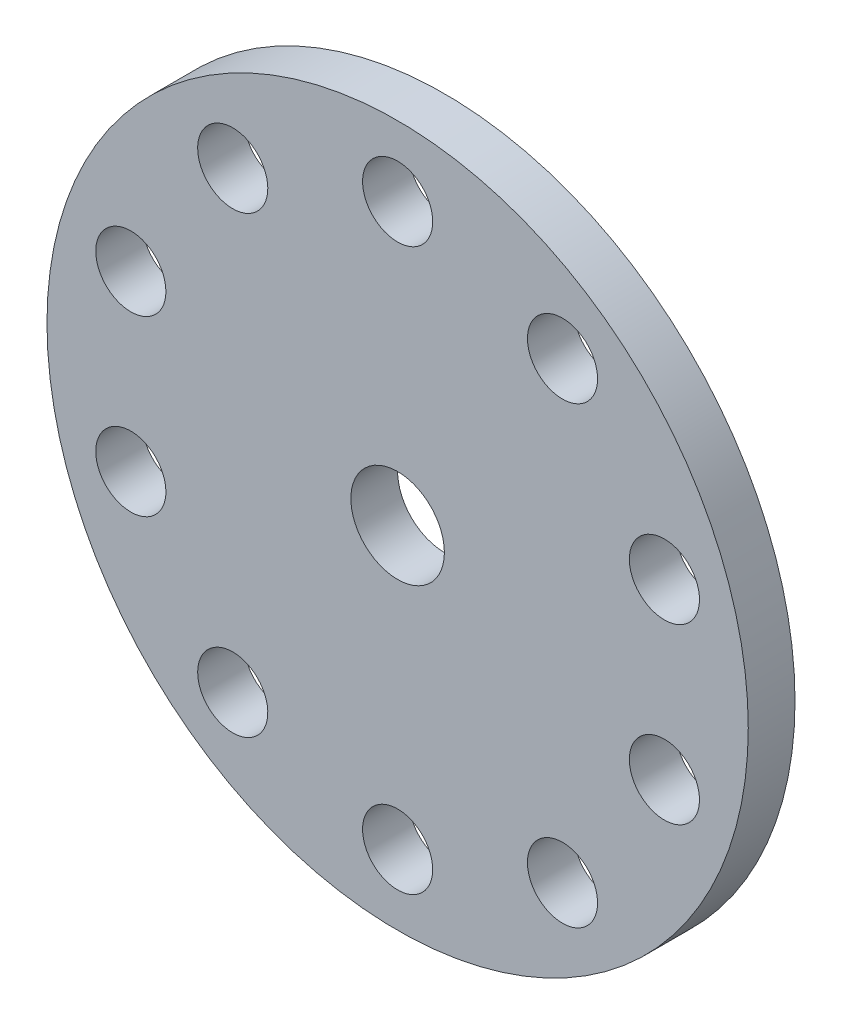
from build123d import *

# Parameters (mm, degrees)
SZKIC1_R                    = 150
SZKIC1_R_2                  = 20
DODANIE_WYCI_GNI_CIE1_DEPTH = 20
SZKIC2_R                    = 15
WYTNIJ_WYCI_GNI_CIE1_DEPTH  = 214.072757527
SZYK_KO_OWY1_COUNT          = 10


with BuildPart() as part:
    # Szkic1 → Dodanie-wyci_gni_cie1 (new body)
    with BuildSketch(Plane.XY):
        Circle(SZKIC1_R)
        Circle(SZKIC1_R_2, mode=Mode.SUBTRACT)
    extrude(amount=DODANIE_WYCI_GNI_CIE1_DEPTH)

    # Szkic2 → Wytnij-wyci_gni_cie1 (cut, through all)
    with BuildSketch(Plane.XY.offset(20)):
        with Locations((0, 120)):
            Circle(SZKIC2_R)
    wytnij_wyci_gni_cie1 = extrude(amount=-WYTNIJ_WYCI_GNI_CIE1_DEPTH, mode=Mode.SUBTRACT)

    # Szyk ko_owy1: Wytnij-wyci_gni_cie1 ×10 about axis
    szyk_ko_owy1_axis = Axis((0, 0, 0), (0, 0, 1))
    for i in range(1, SZYK_KO_OWY1_COUNT):
        add(wytnij_wyci_gni_cie1.rotate(szyk_ko_owy1_axis, i * 360 / SZYK_KO_OWY1_COUNT), mode=Mode.SUBTRACT)


solid = part.part
